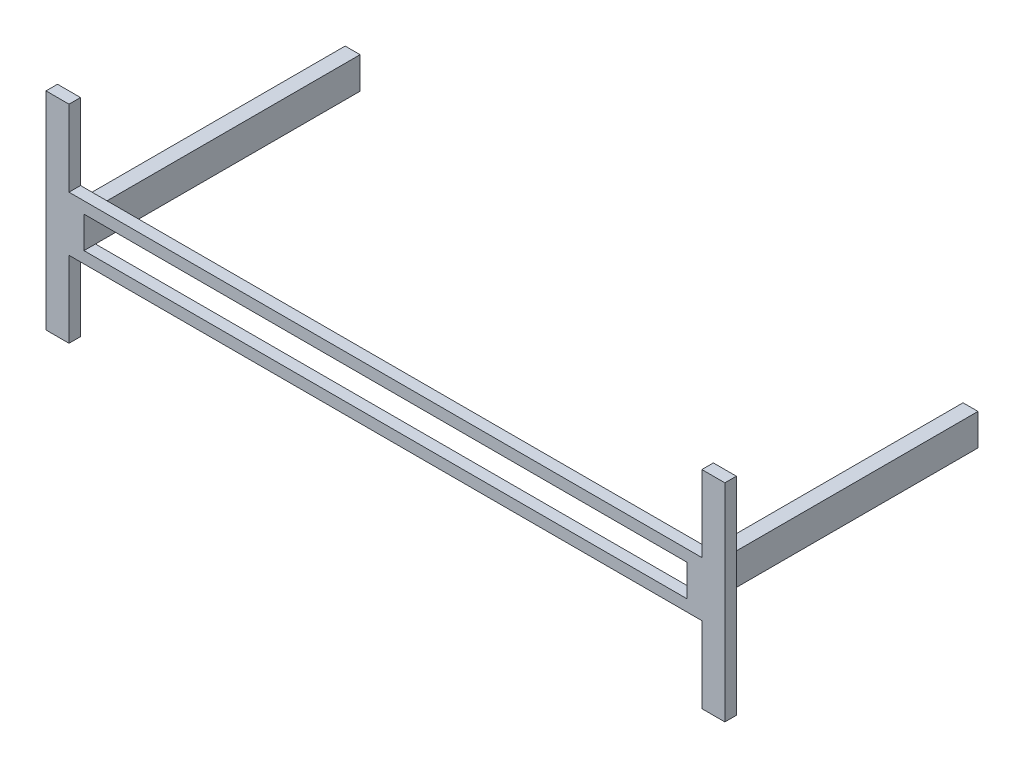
from build123d import *

# Parameters (mm, degrees)
SKETCH1_W             = 33.02
SKETCH1_H             = 69.85
BOSS_EXTRUDE1_DEPTH   = 609.6
BOSS_EXTRUDE1_2_DEPTH = 609.6
SKETCH1_3_W           = 1397
SKETCH1_3_H           = 69.85
BOSS_EXTRUDE2_DEPTH   = 25.4


with BuildPart() as part:
    # Sketch1 → Boss-Extrude1 (new body)
    with BuildSketch(Plane.XY):
        with Locations((-681.99, 0)):
            Rectangle(SKETCH1_W, SKETCH1_H)
    extrude(amount=-BOSS_EXTRUDE1_DEPTH)



with BuildPart() as body_2:
    # Sketch1 → Boss-Extrude1 2 (new body)
    with BuildSketch(Plane.XY):
        with Locations((681.99, 0)):
            Rectangle(SKETCH1_W, SKETCH1_H)
    extrude(amount=-BOSS_EXTRUDE1_2_DEPTH)


with BuildPart() as part_1:
    add(part.part)

    add(body_2.part)  # Boss-Extrude2 merges body 2
    # Sketch1_3 → Boss-Extrude2 (add)
    with BuildSketch(Plane.XY):
        Polygon((698.5, 60.325), (-698.5, 60.325), (-698.5, 228.6), (-749.3, 228.6), (-749.3, -228.6), (-698.5, -228.6), (-698.5, -60.325), (698.5, -60.325), (698.5, -228.6), (749.3, -228.6), (749.3, 228.6), (698.5, 228.6), align=None)
        Rectangle(SKETCH1_3_W, SKETCH1_3_H, mode=Mode.SUBTRACT)
    extrude(amount=-BOSS_EXTRUDE2_DEPTH)


solid = part_1.part
